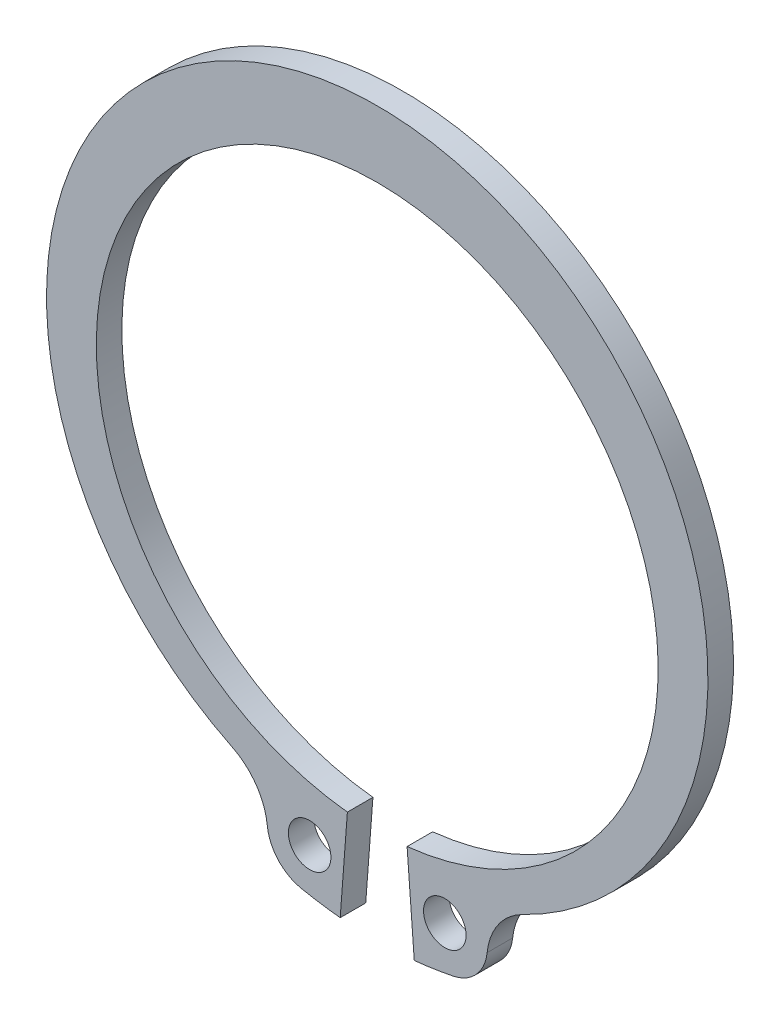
from build123d import *

# Parameters (mm, degrees)
ESQUISSE1_R          = 1.25
BASE_EXTRUSION_DEPTH = 1.5


with BuildPart() as part:
    # Esquisse1 → Base-Extrusion (new body)
    with BuildSketch(Plane.XY):
        with BuildLine():
            Line((1.753400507, -16.406571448), (2.175278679, -21.990657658))
            ThreePointArc((2.175278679, -21.990657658), (3.330204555, -21.845608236), (4.475890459, -21.639946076))
            ThreePointArc((4.475890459, -21.639946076), (5.823252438, -20.869168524), (6.45596942, -19.45172309))
            ThreePointArc((6.45596942, -19.45172309), (7.111869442, -17.693538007), (8.537478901, -16.473268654))
            ThreePointArc((8.537478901, -16.473268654), (0, 20.4), (-8.537478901, -16.473268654))
            ThreePointArc((-8.537478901, -16.473268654), (-7.111869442, -17.693538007), (-6.45596942, -19.45172309))
            ThreePointArc((-6.45596942, -19.45172309), (-5.823252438, -20.869168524), (-4.475890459, -21.639946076))
            ThreePointArc((-4.475890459, -21.639946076), (-3.330204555, -21.845608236), (-2.175278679, -21.990657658))
            Line((-2.175278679, -21.990657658), (-1.753400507, -16.406571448))
            ThreePointArc((-1.753400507, -16.406571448), (0, 16.5), (1.753400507, -16.406571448))
        make_face()
        with Locations((3.969521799, -19.191764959)):
            Circle(ESQUISSE1_R, mode=Mode.SUBTRACT)
        with Locations(Location((-3.969521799, -19.191764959, 0), (0, 0, 180))):
            Circle(ESQUISSE1_R, mode=Mode.SUBTRACT)
    extrude(amount=BASE_EXTRUSION_DEPTH)


solid = part.part
